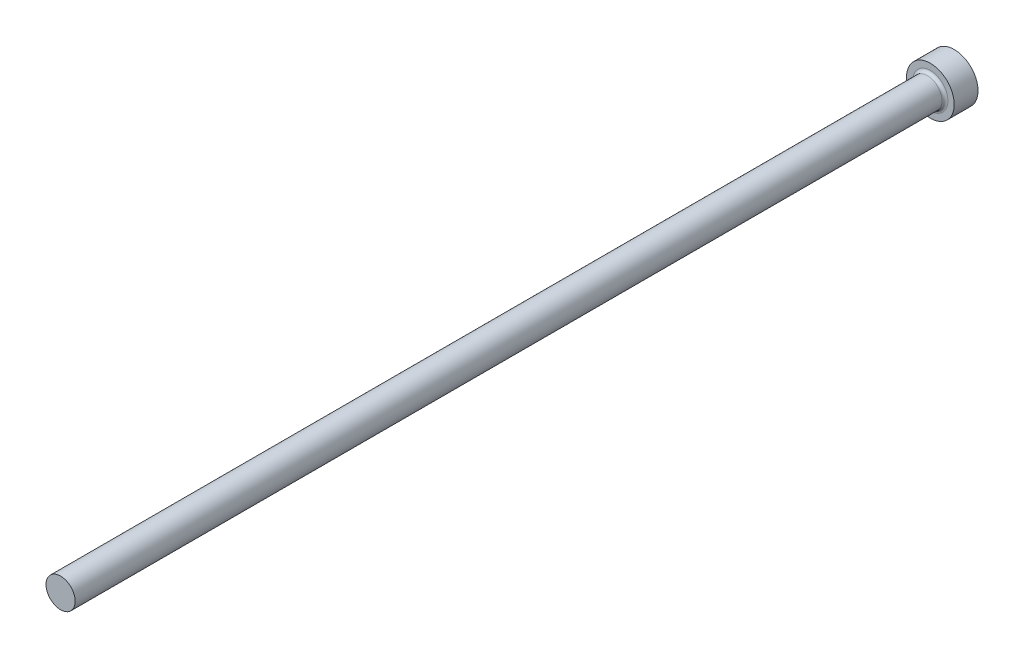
from build123d import *

# Parameters (mm, degrees)
FILLET1_R = 0.5


with BuildPart() as part:
    # FV → Revolve1 (revolve)
    with BuildSketch(Plane(origin=(0, 0, 0), x_dir=(1, 0, 0), z_dir=(0, 1, 0)), mode=Mode.PRIVATE) as revolve1_sk:
        Polygon((0, 0), (4, 0), (4, -4), (2.45, -4), (2.45, -150), (0, -150), align=None)
    revolve(revolve1_sk.sketch.rotate(Axis((0, 0, -9.033228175), (0, 0, 1)), 180), axis=Axis((0, 0, -9.033228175), (0, 0, 1)))

    # Fillet1
    fillet1_edges = [part.edges().sort_by_distance(p)[0] for p in [
        (2.45, 0, 4),
    ]]
    fillet(fillet1_edges, radius=FILLET1_R)


solid = part.part
